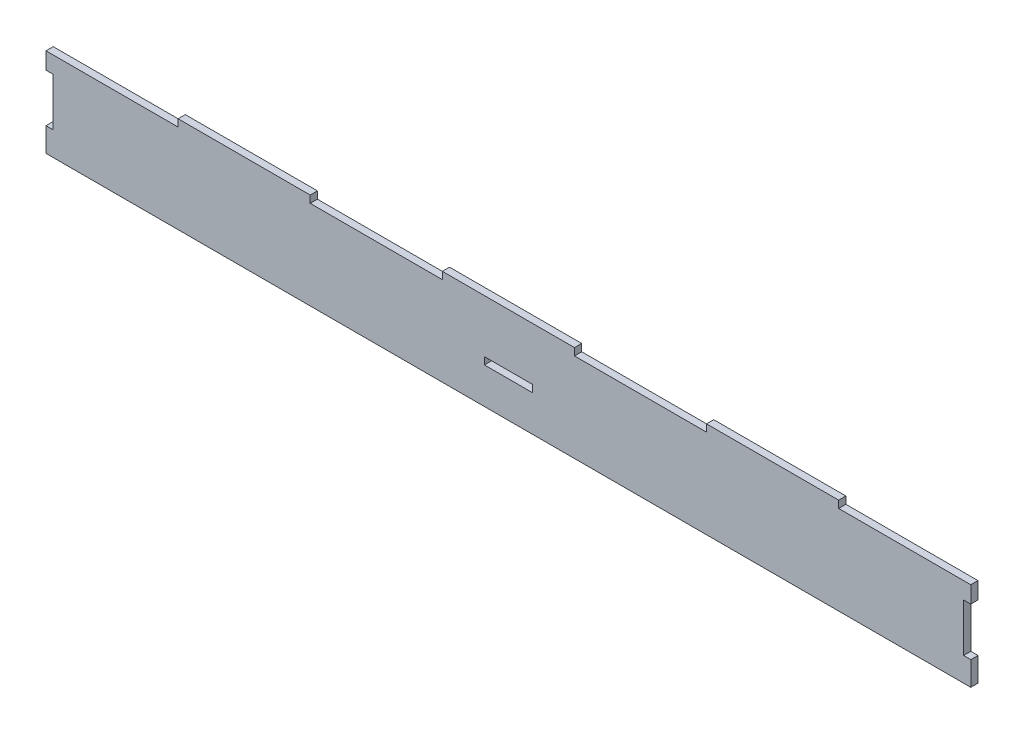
ISO-10303-21;
HEADER;
FILE_DESCRIPTION(('STEP AP214'),'2;1');
FILE_NAME('part.step','',(''),(''),'','','');
FILE_SCHEMA(('AUTOMOTIVE_DESIGN { 1 0 10303 214 1 1 1 1 }'));
ENDSEC;
DATA;
#1=APPLICATION_CONTEXT('core data for automotive mechanical design processes');
#2=APPLICATION_PROTOCOL_DEFINITION('international standard','automotive_design',2000,#1);
#3=PRODUCT_CONTEXT('',#1,'mechanical');
#4=PRODUCT('Part','Part','',(#3));
#5=PRODUCT_RELATED_PRODUCT_CATEGORY('part','',(#4));
#6=PRODUCT_DEFINITION_FORMATION('','',#4);
#7=PRODUCT_DEFINITION_CONTEXT('part definition',#1,'design');
#8=PRODUCT_DEFINITION('design','',#6,#7);
#9=PRODUCT_DEFINITION_SHAPE('','',#8);
#10=(LENGTH_UNIT() NAMED_UNIT(*) SI_UNIT(.MILLI.,.METRE.));
#11=(NAMED_UNIT(*) PLANE_ANGLE_UNIT() SI_UNIT($,.RADIAN.));
#12=(NAMED_UNIT(*) SI_UNIT($,.STERADIAN.) SOLID_ANGLE_UNIT());
#13=UNCERTAINTY_MEASURE_WITH_UNIT(LENGTH_MEASURE(1.E-05),#10,'distance_accuracy_value','');
#14=(GEOMETRIC_REPRESENTATION_CONTEXT(3) GLOBAL_UNCERTAINTY_ASSIGNED_CONTEXT((#13)) GLOBAL_UNIT_ASSIGNED_CONTEXT((#10,
#11,#12)) REPRESENTATION_CONTEXT('',''));
#15=CARTESIAN_POINT('',(0.,0.,0.));
#16=DIRECTION('',(0.,0.,1.));
#17=DIRECTION('',(1.,0.,0.));
#18=AXIS2_PLACEMENT_3D('',#15,#16,#17);
#19=CARTESIAN_POINT('',(192.5,20.,3.));
#20=DIRECTION('',(-1.,0.,0.));
#21=DIRECTION('',(0.,0.,1.));
#22=AXIS2_PLACEMENT_3D('',#19,#20,#21);
#23=PLANE('',#22);
#24=DIRECTION('',(0.,1.,0.));
#25=VECTOR('',#24,1.);
#26=CARTESIAN_POINT('',(192.5,20.,3.));
#27=LINE('',#26,#25);
#28=CARTESIAN_POINT('',(192.5,9.99999999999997,3.));
#29=VERTEX_POINT('',#28);
#30=CARTESIAN_POINT('',(192.5,17.,3.));
#31=VERTEX_POINT('',#30);
#32=EDGE_CURVE('E404',#29,#31,#27,.T.);
#33=ORIENTED_EDGE('',*,*,#32,.F.);
#34=DIRECTION('',(0.,0.,1.));
#35=VECTOR('',#34,1.);
#36=CARTESIAN_POINT('',(192.5,9.99999999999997,0.));
#37=LINE('',#36,#35);
#38=CARTESIAN_POINT('',(192.5,9.99999999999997,0.));
#39=VERTEX_POINT('',#38);
#40=EDGE_CURVE('E276',#39,#29,#37,.T.);
#41=ORIENTED_EDGE('',*,*,#40,.F.);
#42=DIRECTION('',(0.,1.,0.));
#43=VECTOR('',#42,1.);
#44=CARTESIAN_POINT('',(192.5,20.,0.));
#45=LINE('',#44,#43);
#46=CARTESIAN_POINT('',(192.5,17.,0.));
#47=VERTEX_POINT('',#46);
#48=EDGE_CURVE('E396',#39,#47,#45,.T.);
#49=ORIENTED_EDGE('',*,*,#48,.T.);
#50=DIRECTION('',(0.,0.,1.));
#51=VECTOR('',#50,1.);
#52=CARTESIAN_POINT('',(192.5,17.,0.));
#53=LINE('',#52,#51);
#54=EDGE_CURVE('E323',#47,#31,#53,.T.);
#55=ORIENTED_EDGE('',*,*,#54,.T.);
#56=EDGE_LOOP('',(#33,#41,#49,#55));
#57=FACE_BOUND('',#56,.T.);
#58=ADVANCED_FACE('F34',(#57),#23,.F.);
#59=CARTESIAN_POINT('',(-192.5,20.,3.));
#60=DIRECTION('',(1.,0.,0.));
#61=DIRECTION('',(0.,0.,-1.));
#62=AXIS2_PLACEMENT_3D('',#59,#60,#61);
#63=PLANE('',#62);
#64=DIRECTION('',(0.,-1.,0.));
#65=VECTOR('',#64,1.);
#66=CARTESIAN_POINT('',(-192.5,20.,0.));
#67=LINE('',#66,#65);
#68=CARTESIAN_POINT('',(-192.5,17.,0.));
#69=VERTEX_POINT('',#68);
#70=CARTESIAN_POINT('',(-192.5,9.99999999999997,0.));
#71=VERTEX_POINT('',#70);
#72=EDGE_CURVE('E422',#69,#71,#67,.T.);
#73=ORIENTED_EDGE('',*,*,#72,.T.);
#74=DIRECTION('',(0.,0.,1.));
#75=VECTOR('',#74,1.);
#76=CARTESIAN_POINT('',(-192.5,9.99999999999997,0.));
#77=LINE('',#76,#75);
#78=CARTESIAN_POINT('',(-192.5,9.99999999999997,3.));
#79=VERTEX_POINT('',#78);
#80=EDGE_CURVE('E299',#71,#79,#77,.T.);
#81=ORIENTED_EDGE('',*,*,#80,.T.);
#82=DIRECTION('',(0.,-1.,0.));
#83=VECTOR('',#82,1.);
#84=CARTESIAN_POINT('',(-192.5,20.,3.));
#85=LINE('',#84,#83);
#86=CARTESIAN_POINT('',(-192.5,17.,3.));
#87=VERTEX_POINT('',#86);
#88=EDGE_CURVE('E409',#87,#79,#85,.T.);
#89=ORIENTED_EDGE('',*,*,#88,.F.);
#90=DIRECTION('',(0.,0.,1.));
#91=VECTOR('',#90,1.);
#92=CARTESIAN_POINT('',(-192.5,17.,0.));
#93=LINE('',#92,#91);
#94=EDGE_CURVE('E388',#69,#87,#93,.T.);
#95=ORIENTED_EDGE('',*,*,#94,.F.);
#96=EDGE_LOOP('',(#73,#81,#89,#95));
#97=FACE_BOUND('',#96,.T.);
#98=ADVANCED_FACE('F465',(#97),#63,.F.);
#99=CARTESIAN_POINT('',(-192.5,20.,3.));
#100=DIRECTION('',(0.,-1.,0.));
#101=DIRECTION('',(0.,0.,-1.));
#102=AXIS2_PLACEMENT_3D('',#99,#100,#101);
#103=PLANE('',#102);
#104=DIRECTION('',(-1.,0.,0.));
#105=VECTOR('',#104,1.);
#106=CARTESIAN_POINT('',(-192.5,20.,3.));
#107=LINE('',#106,#105);
#108=CARTESIAN_POINT('',(27.5,20.,3.));
#109=VERTEX_POINT('',#108);
#110=CARTESIAN_POINT('',(-27.5,20.,3.));
#111=VERTEX_POINT('',#110);
#112=EDGE_CURVE('E408',#109,#111,#107,.T.);
#113=ORIENTED_EDGE('',*,*,#112,.F.);
#114=DIRECTION('',(0.,0.,1.));
#115=VECTOR('',#114,1.);
#116=CARTESIAN_POINT('',(27.5,20.,0.));
#117=LINE('',#116,#115);
#118=CARTESIAN_POINT('',(27.5,20.,0.));
#119=VERTEX_POINT('',#118);
#120=EDGE_CURVE('E345',#119,#109,#117,.T.);
#121=ORIENTED_EDGE('',*,*,#120,.F.);
#122=DIRECTION('',(-1.,0.,0.));
#123=VECTOR('',#122,1.);
#124=CARTESIAN_POINT('',(-192.5,20.,0.));
#125=LINE('',#124,#123);
#126=CARTESIAN_POINT('',(-27.5,20.,0.));
#127=VERTEX_POINT('',#126);
#128=EDGE_CURVE('E421',#119,#127,#125,.T.);
#129=ORIENTED_EDGE('',*,*,#128,.T.);
#130=DIRECTION('',(0.,0.,1.));
#131=VECTOR('',#130,1.);
#132=CARTESIAN_POINT('',(-27.5,20.,0.));
#133=LINE('',#132,#131);
#134=EDGE_CURVE('E375',#127,#111,#133,.T.);
#135=ORIENTED_EDGE('',*,*,#134,.T.);
#136=EDGE_LOOP('',(#113,#121,#129,#135));
#137=FACE_BOUND('',#136,.T.);
#138=ADVANCED_FACE('F486',(#137),#103,.F.);
#139=CARTESIAN_POINT('',(-82.5,20.,3.));
#140=VERTEX_POINT('',#139);
#141=CARTESIAN_POINT('',(-137.5,20.,3.));
#142=VERTEX_POINT('',#141);
#143=EDGE_CURVE('E403',#140,#142,#107,.T.);
#144=ORIENTED_EDGE('',*,*,#143,.F.);
#145=DIRECTION('',(0.,0.,1.));
#146=VECTOR('',#145,1.);
#147=CARTESIAN_POINT('',(-82.5,20.,0.));
#148=LINE('',#147,#146);
#149=CARTESIAN_POINT('',(-82.5,20.,0.));
#150=VERTEX_POINT('',#149);
#151=EDGE_CURVE('E372',#150,#140,#148,.T.);
#152=ORIENTED_EDGE('',*,*,#151,.F.);
#153=CARTESIAN_POINT('',(-137.5,20.,0.));
#154=VERTEX_POINT('',#153);
#155=EDGE_CURVE('E417',#150,#154,#125,.T.);
#156=ORIENTED_EDGE('',*,*,#155,.T.);
#157=DIRECTION('',(0.,0.,1.));
#158=VECTOR('',#157,1.);
#159=CARTESIAN_POINT('',(-137.5,20.,0.));
#160=LINE('',#159,#158);
#161=EDGE_CURVE('E393',#154,#142,#160,.T.);
#162=ORIENTED_EDGE('',*,*,#161,.T.);
#163=EDGE_LOOP('',(#144,#152,#156,#162));
#164=FACE_BOUND('',#163,.T.);
#165=ADVANCED_FACE('F478',(#164),#103,.F.);
#166=CARTESIAN_POINT('',(192.5,-20.,0.));
#167=VERTEX_POINT('',#166);
#168=CARTESIAN_POINT('',(192.5,-10.,0.));
#169=VERTEX_POINT('',#168);
#170=EDGE_CURVE('E414',#167,#169,#45,.T.);
#171=ORIENTED_EDGE('',*,*,#170,.T.);
#172=DIRECTION('',(0.,0.,1.));
#173=VECTOR('',#172,1.);
#174=CARTESIAN_POINT('',(192.5,-10.,0.));
#175=LINE('',#174,#173);
#176=CARTESIAN_POINT('',(192.5,-10.,3.));
#177=VERTEX_POINT('',#176);
#178=EDGE_CURVE('E278',#169,#177,#175,.T.);
#179=ORIENTED_EDGE('',*,*,#178,.T.);
#180=CARTESIAN_POINT('',(192.5,-20.,3.));
#181=VERTEX_POINT('',#180);
#182=EDGE_CURVE('E400',#181,#177,#27,.T.);
#183=ORIENTED_EDGE('',*,*,#182,.F.);
#184=DIRECTION('',(0.,0.,-1.));
#185=VECTOR('',#184,1.);
#186=CARTESIAN_POINT('',(192.5,-20.,3.));
#187=LINE('',#186,#185);
#188=EDGE_CURVE('E42',#181,#167,#187,.T.);
#189=ORIENTED_EDGE('',*,*,#188,.T.);
#190=EDGE_LOOP('',(#171,#179,#183,#189));
#191=FACE_BOUND('',#190,.T.);
#192=ADVANCED_FACE('F36',(#191),#23,.F.);
#193=CARTESIAN_POINT('',(137.5,20.,3.));
#194=VERTEX_POINT('',#193);
#195=CARTESIAN_POINT('',(82.5,20.,3.));
#196=VERTEX_POINT('',#195);
#197=EDGE_CURVE('E405',#194,#196,#107,.T.);
#198=ORIENTED_EDGE('',*,*,#197,.F.);
#199=DIRECTION('',(0.,0.,1.));
#200=VECTOR('',#199,1.);
#201=CARTESIAN_POINT('',(137.5,20.,0.));
#202=LINE('',#201,#200);
#203=CARTESIAN_POINT('',(137.5,20.,0.));
#204=VERTEX_POINT('',#203);
#205=EDGE_CURVE('E320',#204,#194,#202,.T.);
#206=ORIENTED_EDGE('',*,*,#205,.F.);
#207=CARTESIAN_POINT('',(82.5,20.,0.));
#208=VERTEX_POINT('',#207);
#209=EDGE_CURVE('E418',#204,#208,#125,.T.);
#210=ORIENTED_EDGE('',*,*,#209,.T.);
#211=DIRECTION('',(0.,0.,1.));
#212=VECTOR('',#211,1.);
#213=CARTESIAN_POINT('',(82.5,20.,0.));
#214=LINE('',#213,#212);
#215=EDGE_CURVE('E348',#208,#196,#214,.T.);
#216=ORIENTED_EDGE('',*,*,#215,.T.);
#217=EDGE_LOOP('',(#198,#206,#210,#216));
#218=FACE_BOUND('',#217,.T.);
#219=ADVANCED_FACE('F510',(#218),#103,.F.);
#220=CARTESIAN_POINT('',(-192.5,-10.,3.));
#221=VERTEX_POINT('',#220);
#222=CARTESIAN_POINT('',(-192.5,-20.,3.));
#223=VERTEX_POINT('',#222);
#224=EDGE_CURVE('E407',#221,#223,#85,.T.);
#225=ORIENTED_EDGE('',*,*,#224,.F.);
#226=DIRECTION('',(0.,0.,1.));
#227=VECTOR('',#226,1.);
#228=CARTESIAN_POINT('',(-192.5,-10.,0.));
#229=LINE('',#228,#227);
#230=CARTESIAN_POINT('',(-192.5,-10.,0.));
#231=VERTEX_POINT('',#230);
#232=EDGE_CURVE('E292',#231,#221,#229,.T.);
#233=ORIENTED_EDGE('',*,*,#232,.F.);
#234=CARTESIAN_POINT('',(-192.5,-20.,0.));
#235=VERTEX_POINT('',#234);
#236=EDGE_CURVE('E420',#231,#235,#67,.T.);
#237=ORIENTED_EDGE('',*,*,#236,.T.);
#238=DIRECTION('',(0.,0.,-1.));
#239=VECTOR('',#238,1.);
#240=CARTESIAN_POINT('',(-192.5,-20.,3.));
#241=LINE('',#240,#239);
#242=EDGE_CURVE('E11',#223,#235,#241,.T.);
#243=ORIENTED_EDGE('',*,*,#242,.F.);
#244=EDGE_LOOP('',(#225,#233,#237,#243));
#245=FACE_BOUND('',#244,.T.);
#246=ADVANCED_FACE('F450',(#245),#63,.F.);
#247=CARTESIAN_POINT('',(-192.5,-20.,3.));
#248=DIRECTION('',(0.,1.,0.));
#249=DIRECTION('',(0.,0.,1.));
#250=AXIS2_PLACEMENT_3D('',#247,#248,#249);
#251=PLANE('',#250);
#252=DIRECTION('',(1.,0.,0.));
#253=VECTOR('',#252,1.);
#254=CARTESIAN_POINT('',(-192.5,-20.,0.));
#255=LINE('',#254,#253);
#256=EDGE_CURVE('E425',#235,#167,#255,.T.);
#257=ORIENTED_EDGE('',*,*,#256,.T.);
#258=ORIENTED_EDGE('',*,*,#188,.F.);
#259=DIRECTION('',(1.,0.,0.));
#260=VECTOR('',#259,1.);
#261=CARTESIAN_POINT('',(-192.5,-20.,3.));
#262=LINE('',#261,#260);
#263=EDGE_CURVE('E412',#223,#181,#262,.T.);
#264=ORIENTED_EDGE('',*,*,#263,.F.);
#265=ORIENTED_EDGE('',*,*,#242,.T.);
#266=EDGE_LOOP('',(#257,#258,#264,#265));
#267=FACE_BOUND('',#266,.T.);
#268=ADVANCED_FACE('F448',(#267),#251,.F.);
#269=CARTESIAN_POINT('',(0.,0.,3.));
#270=DIRECTION('',(0.,0.,1.));
#271=DIRECTION('',(1.,0.,0.));
#272=AXIS2_PLACEMENT_3D('',#269,#270,#271);
#273=PLANE('',#272);
#274=DIRECTION('',(0.,1.,0.));
#275=VECTOR('',#274,1.);
#276=CARTESIAN_POINT('',(10.,-2.,3.));
#277=LINE('',#276,#275);
#278=CARTESIAN_POINT('',(10.,-5.,3.));
#279=VERTEX_POINT('',#278);
#280=CARTESIAN_POINT('',(10.,-2.,3.));
#281=VERTEX_POINT('',#280);
#282=EDGE_CURVE('E49',#279,#281,#277,.T.);
#283=ORIENTED_EDGE('',*,*,#282,.F.);
#284=DIRECTION('',(1.,0.,0.));
#285=VECTOR('',#284,1.);
#286=CARTESIAN_POINT('',(-10.,-5.,3.));
#287=LINE('',#286,#285);
#288=CARTESIAN_POINT('',(-10.,-5.,3.));
#289=VERTEX_POINT('',#288);
#290=EDGE_CURVE('E237',#289,#279,#287,.T.);
#291=ORIENTED_EDGE('',*,*,#290,.F.);
#292=DIRECTION('',(0.,-1.,0.));
#293=VECTOR('',#292,1.);
#294=CARTESIAN_POINT('',(-10.,-2.,3.));
#295=LINE('',#294,#293);
#296=CARTESIAN_POINT('',(-10.,-2.,3.));
#297=VERTEX_POINT('',#296);
#298=EDGE_CURVE('E240',#297,#289,#295,.T.);
#299=ORIENTED_EDGE('',*,*,#298,.F.);
#300=DIRECTION('',(-1.,0.,0.));
#301=VECTOR('',#300,1.);
#302=CARTESIAN_POINT('',(-10.,-2.,3.));
#303=LINE('',#302,#301);
#304=EDGE_CURVE('E246',#281,#297,#303,.T.);
#305=ORIENTED_EDGE('',*,*,#304,.F.);
#306=EDGE_LOOP('',(#283,#291,#299,#305));
#307=FACE_BOUND('',#306,.T.);
#308=DIRECTION('',(-1.,0.,0.));
#309=VECTOR('',#308,1.);
#310=CARTESIAN_POINT('',(189.5,9.99999999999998,3.));
#311=LINE('',#310,#309);
#312=CARTESIAN_POINT('',(189.5,9.99999999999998,3.));
#313=VERTEX_POINT('',#312);
#314=EDGE_CURVE('E260',#29,#313,#311,.T.);
#315=ORIENTED_EDGE('',*,*,#314,.F.);
#316=ORIENTED_EDGE('',*,*,#32,.T.);
#317=DIRECTION('',(1.,0.,0.));
#318=VECTOR('',#317,1.);
#319=CARTESIAN_POINT('',(137.5,17.,3.));
#320=LINE('',#319,#318);
#321=CARTESIAN_POINT('',(137.5,17.,3.));
#322=VERTEX_POINT('',#321);
#323=EDGE_CURVE('E312',#322,#31,#320,.T.);
#324=ORIENTED_EDGE('',*,*,#323,.F.);
#325=DIRECTION('',(0.,-1.,0.));
#326=VECTOR('',#325,1.);
#327=CARTESIAN_POINT('',(137.5,20.,3.));
#328=LINE('',#327,#326);
#329=EDGE_CURVE('E302',#194,#322,#328,.T.);
#330=ORIENTED_EDGE('',*,*,#329,.F.);
#331=ORIENTED_EDGE('',*,*,#197,.T.);
#332=DIRECTION('',(0.,1.,0.));
#333=VECTOR('',#332,1.);
#334=CARTESIAN_POINT('',(82.5,20.,3.));
#335=LINE('',#334,#333);
#336=CARTESIAN_POINT('',(82.5,17.,3.));
#337=VERTEX_POINT('',#336);
#338=EDGE_CURVE('E331',#337,#196,#335,.T.);
#339=ORIENTED_EDGE('',*,*,#338,.F.);
#340=DIRECTION('',(1.,0.,0.));
#341=VECTOR('',#340,1.);
#342=CARTESIAN_POINT('',(27.5,17.,3.));
#343=LINE('',#342,#341);
#344=CARTESIAN_POINT('',(27.5,17.,3.));
#345=VERTEX_POINT('',#344);
#346=EDGE_CURVE('E340',#345,#337,#343,.T.);
#347=ORIENTED_EDGE('',*,*,#346,.F.);
#348=DIRECTION('',(0.,-1.,0.));
#349=VECTOR('',#348,1.);
#350=CARTESIAN_POINT('',(27.5,20.,3.));
#351=LINE('',#350,#349);
#352=EDGE_CURVE('E322',#109,#345,#351,.T.);
#353=ORIENTED_EDGE('',*,*,#352,.F.);
#354=ORIENTED_EDGE('',*,*,#112,.T.);
#355=DIRECTION('',(0.,1.,0.));
#356=VECTOR('',#355,1.);
#357=CARTESIAN_POINT('',(-27.5,20.,3.));
#358=LINE('',#357,#356);
#359=CARTESIAN_POINT('',(-27.5,17.,3.));
#360=VERTEX_POINT('',#359);
#361=EDGE_CURVE('E358',#360,#111,#358,.T.);
#362=ORIENTED_EDGE('',*,*,#361,.F.);
#363=DIRECTION('',(1.,0.,0.));
#364=VECTOR('',#363,1.);
#365=CARTESIAN_POINT('',(-82.5,17.,3.));
#366=LINE('',#365,#364);
#367=CARTESIAN_POINT('',(-82.5,17.,3.));
#368=VERTEX_POINT('',#367);
#369=EDGE_CURVE('E367',#368,#360,#366,.T.);
#370=ORIENTED_EDGE('',*,*,#369,.F.);
#371=DIRECTION('',(0.,-1.,0.));
#372=VECTOR('',#371,1.);
#373=CARTESIAN_POINT('',(-82.5,20.,3.));
#374=LINE('',#373,#372);
#375=EDGE_CURVE('E347',#140,#368,#374,.T.);
#376=ORIENTED_EDGE('',*,*,#375,.F.);
#377=ORIENTED_EDGE('',*,*,#143,.T.);
#378=DIRECTION('',(0.,1.,0.));
#379=VECTOR('',#378,1.);
#380=CARTESIAN_POINT('',(-137.5,20.,3.));
#381=LINE('',#380,#379);
#382=CARTESIAN_POINT('',(-137.5,17.,3.));
#383=VERTEX_POINT('',#382);
#384=EDGE_CURVE('E385',#383,#142,#381,.T.);
#385=ORIENTED_EDGE('',*,*,#384,.F.);
#386=DIRECTION('',(1.,0.,0.));
#387=VECTOR('',#386,1.);
#388=CARTESIAN_POINT('',(-192.5,17.,3.));
#389=LINE('',#388,#387);
#390=EDGE_CURVE('E374',#87,#383,#389,.T.);
#391=ORIENTED_EDGE('',*,*,#390,.F.);
#392=ORIENTED_EDGE('',*,*,#88,.T.);
#393=DIRECTION('',(-1.,0.,0.));
#394=VECTOR('',#393,1.);
#395=CARTESIAN_POINT('',(-189.5,9.99999999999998,3.));
#396=LINE('',#395,#394);
#397=CARTESIAN_POINT('',(-189.5,9.99999999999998,3.));
#398=VERTEX_POINT('',#397);
#399=EDGE_CURVE('E286',#398,#79,#396,.T.);
#400=ORIENTED_EDGE('',*,*,#399,.F.);
#401=DIRECTION('',(0.,1.,0.));
#402=VECTOR('',#401,1.);
#403=CARTESIAN_POINT('',(-189.5,9.99999999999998,3.));
#404=LINE('',#403,#402);
#405=CARTESIAN_POINT('',(-189.5,-10.,3.));
#406=VERTEX_POINT('',#405);
#407=EDGE_CURVE('E295',#406,#398,#404,.T.);
#408=ORIENTED_EDGE('',*,*,#407,.F.);
#409=DIRECTION('',(1.,0.,0.));
#410=VECTOR('',#409,1.);
#411=CARTESIAN_POINT('',(-189.5,-10.,3.));
#412=LINE('',#411,#410);
#413=EDGE_CURVE('E275',#221,#406,#412,.T.);
#414=ORIENTED_EDGE('',*,*,#413,.F.);
#415=ORIENTED_EDGE('',*,*,#224,.T.);
#416=ORIENTED_EDGE('',*,*,#263,.T.);
#417=ORIENTED_EDGE('',*,*,#182,.T.);
#418=DIRECTION('',(1.,0.,0.));
#419=VECTOR('',#418,1.);
#420=CARTESIAN_POINT('',(189.5,-10.,3.));
#421=LINE('',#420,#419);
#422=CARTESIAN_POINT('',(189.5,-10.,3.));
#423=VERTEX_POINT('',#422);
#424=EDGE_CURVE('E269',#423,#177,#421,.T.);
#425=ORIENTED_EDGE('',*,*,#424,.F.);
#426=DIRECTION('',(0.,-1.,0.));
#427=VECTOR('',#426,1.);
#428=CARTESIAN_POINT('',(189.5,9.99999999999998,3.));
#429=LINE('',#428,#427);
#430=EDGE_CURVE('E252',#313,#423,#429,.T.);
#431=ORIENTED_EDGE('',*,*,#430,.F.);
#432=EDGE_LOOP('',(#315,#316,#324,#330,#331,#339,#347,#353,#354,#362,#370,#376,#377,#385,#391,
#392,#400,#408,#414,#415,#416,#417,#425,#431));
#433=FACE_BOUND('',#432,.T.);
#434=ADVANCED_FACE('F443',(#307,#433),#273,.T.);
#435=CARTESIAN_POINT('',(0.,0.,0.));
#436=DIRECTION('',(0.,0.,1.));
#437=DIRECTION('',(1.,0.,0.));
#438=AXIS2_PLACEMENT_3D('',#435,#436,#437);
#439=PLANE('',#438);
#440=DIRECTION('',(1.,0.,0.));
#441=VECTOR('',#440,1.);
#442=CARTESIAN_POINT('',(-10.,-5.,0.));
#443=LINE('',#442,#441);
#444=CARTESIAN_POINT('',(-10.,-5.,0.));
#445=VERTEX_POINT('',#444);
#446=CARTESIAN_POINT('',(10.,-5.,0.));
#447=VERTEX_POINT('',#446);
#448=EDGE_CURVE('E227',#445,#447,#443,.T.);
#449=ORIENTED_EDGE('',*,*,#448,.T.);
#450=DIRECTION('',(0.,1.,0.));
#451=VECTOR('',#450,1.);
#452=CARTESIAN_POINT('',(10.,-2.,0.));
#453=LINE('',#452,#451);
#454=CARTESIAN_POINT('',(10.,-2.,0.));
#455=VERTEX_POINT('',#454);
#456=EDGE_CURVE('E221',#447,#455,#453,.T.);
#457=ORIENTED_EDGE('',*,*,#456,.T.);
#458=DIRECTION('',(-1.,0.,0.));
#459=VECTOR('',#458,1.);
#460=CARTESIAN_POINT('',(-10.,-2.,0.));
#461=LINE('',#460,#459);
#462=CARTESIAN_POINT('',(-10.,-2.,0.));
#463=VERTEX_POINT('',#462);
#464=EDGE_CURVE('E230',#455,#463,#461,.T.);
#465=ORIENTED_EDGE('',*,*,#464,.T.);
#466=DIRECTION('',(0.,-1.,0.));
#467=VECTOR('',#466,1.);
#468=CARTESIAN_POINT('',(-10.,-2.,0.));
#469=LINE('',#468,#467);
#470=EDGE_CURVE('E57',#463,#445,#469,.T.);
#471=ORIENTED_EDGE('',*,*,#470,.T.);
#472=EDGE_LOOP('',(#449,#457,#465,#471));
#473=FACE_BOUND('',#472,.T.);
#474=ORIENTED_EDGE('',*,*,#48,.F.);
#475=DIRECTION('',(-1.,0.,0.));
#476=VECTOR('',#475,1.);
#477=CARTESIAN_POINT('',(189.5,9.99999999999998,0.));
#478=LINE('',#477,#476);
#479=CARTESIAN_POINT('',(189.5,9.99999999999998,0.));
#480=VERTEX_POINT('',#479);
#481=EDGE_CURVE('E263',#39,#480,#478,.T.);
#482=ORIENTED_EDGE('',*,*,#481,.T.);
#483=DIRECTION('',(0.,-1.,0.));
#484=VECTOR('',#483,1.);
#485=CARTESIAN_POINT('',(189.5,9.99999999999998,0.));
#486=LINE('',#485,#484);
#487=CARTESIAN_POINT('',(189.5,-10.,0.));
#488=VERTEX_POINT('',#487);
#489=EDGE_CURVE('E256',#480,#488,#486,.T.);
#490=ORIENTED_EDGE('',*,*,#489,.T.);
#491=DIRECTION('',(1.,0.,0.));
#492=VECTOR('',#491,1.);
#493=CARTESIAN_POINT('',(189.5,-10.,0.));
#494=LINE('',#493,#492);
#495=EDGE_CURVE('E259',#488,#169,#494,.T.);
#496=ORIENTED_EDGE('',*,*,#495,.T.);
#497=ORIENTED_EDGE('',*,*,#170,.F.);
#498=ORIENTED_EDGE('',*,*,#256,.F.);
#499=ORIENTED_EDGE('',*,*,#236,.F.);
#500=DIRECTION('',(1.,0.,0.));
#501=VECTOR('',#500,1.);
#502=CARTESIAN_POINT('',(-189.5,-10.,0.));
#503=LINE('',#502,#501);
#504=CARTESIAN_POINT('',(-189.5,-10.,0.));
#505=VERTEX_POINT('',#504);
#506=EDGE_CURVE('E282',#231,#505,#503,.T.);
#507=ORIENTED_EDGE('',*,*,#506,.T.);
#508=DIRECTION('',(0.,1.,0.));
#509=VECTOR('',#508,1.);
#510=CARTESIAN_POINT('',(-189.5,9.99999999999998,0.));
#511=LINE('',#510,#509);
#512=CARTESIAN_POINT('',(-189.5,9.99999999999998,0.));
#513=VERTEX_POINT('',#512);
#514=EDGE_CURVE('E285',#505,#513,#511,.T.);
#515=ORIENTED_EDGE('',*,*,#514,.T.);
#516=DIRECTION('',(-1.,0.,0.));
#517=VECTOR('',#516,1.);
#518=CARTESIAN_POINT('',(-189.5,9.99999999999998,0.));
#519=LINE('',#518,#517);
#520=EDGE_CURVE('E289',#513,#71,#519,.T.);
#521=ORIENTED_EDGE('',*,*,#520,.T.);
#522=ORIENTED_EDGE('',*,*,#72,.F.);
#523=DIRECTION('',(1.,0.,0.));
#524=VECTOR('',#523,1.);
#525=CARTESIAN_POINT('',(-192.5,17.,0.));
#526=LINE('',#525,#524);
#527=CARTESIAN_POINT('',(-137.5,17.,0.));
#528=VERTEX_POINT('',#527);
#529=EDGE_CURVE('E381',#69,#528,#526,.T.);
#530=ORIENTED_EDGE('',*,*,#529,.T.);
#531=DIRECTION('',(0.,1.,0.));
#532=VECTOR('',#531,1.);
#533=CARTESIAN_POINT('',(-137.5,20.,0.));
#534=LINE('',#533,#532);
#535=EDGE_CURVE('E384',#528,#154,#534,.T.);
#536=ORIENTED_EDGE('',*,*,#535,.T.);
#537=ORIENTED_EDGE('',*,*,#155,.F.);
#538=DIRECTION('',(0.,-1.,0.));
#539=VECTOR('',#538,1.);
#540=CARTESIAN_POINT('',(-82.5,20.,0.));
#541=LINE('',#540,#539);
#542=CARTESIAN_POINT('',(-82.5,17.,0.));
#543=VERTEX_POINT('',#542);
#544=EDGE_CURVE('E354',#150,#543,#541,.T.);
#545=ORIENTED_EDGE('',*,*,#544,.T.);
#546=DIRECTION('',(1.,0.,0.));
#547=VECTOR('',#546,1.);
#548=CARTESIAN_POINT('',(-82.5,17.,0.));
#549=LINE('',#548,#547);
#550=CARTESIAN_POINT('',(-27.5,17.,0.));
#551=VERTEX_POINT('',#550);
#552=EDGE_CURVE('E357',#543,#551,#549,.T.);
#553=ORIENTED_EDGE('',*,*,#552,.T.);
#554=DIRECTION('',(0.,1.,0.));
#555=VECTOR('',#554,1.);
#556=CARTESIAN_POINT('',(-27.5,20.,0.));
#557=LINE('',#556,#555);
#558=EDGE_CURVE('E361',#551,#127,#557,.T.);
#559=ORIENTED_EDGE('',*,*,#558,.T.);
#560=ORIENTED_EDGE('',*,*,#128,.F.);
#561=DIRECTION('',(0.,-1.,0.));
#562=VECTOR('',#561,1.);
#563=CARTESIAN_POINT('',(27.5,20.,0.));
#564=LINE('',#563,#562);
#565=CARTESIAN_POINT('',(27.5,17.,0.));
#566=VERTEX_POINT('',#565);
#567=EDGE_CURVE('E327',#119,#566,#564,.T.);
#568=ORIENTED_EDGE('',*,*,#567,.T.);
#569=DIRECTION('',(1.,0.,0.));
#570=VECTOR('',#569,1.);
#571=CARTESIAN_POINT('',(27.5,17.,0.));
#572=LINE('',#571,#570);
#573=CARTESIAN_POINT('',(82.5,17.,0.));
#574=VERTEX_POINT('',#573);
#575=EDGE_CURVE('E330',#566,#574,#572,.T.);
#576=ORIENTED_EDGE('',*,*,#575,.T.);
#577=DIRECTION('',(0.,1.,0.));
#578=VECTOR('',#577,1.);
#579=CARTESIAN_POINT('',(82.5,20.,0.));
#580=LINE('',#579,#578);
#581=EDGE_CURVE('E334',#574,#208,#580,.T.);
#582=ORIENTED_EDGE('',*,*,#581,.T.);
#583=ORIENTED_EDGE('',*,*,#209,.F.);
#584=DIRECTION('',(0.,-1.,0.));
#585=VECTOR('',#584,1.);
#586=CARTESIAN_POINT('',(137.5,20.,0.));
#587=LINE('',#586,#585);
#588=CARTESIAN_POINT('',(137.5,17.,0.));
#589=VERTEX_POINT('',#588);
#590=EDGE_CURVE('E308',#204,#589,#587,.T.);
#591=ORIENTED_EDGE('',*,*,#590,.T.);
#592=DIRECTION('',(1.,0.,0.));
#593=VECTOR('',#592,1.);
#594=CARTESIAN_POINT('',(137.5,17.,0.));
#595=LINE('',#594,#593);
#596=EDGE_CURVE('E311',#589,#47,#595,.T.);
#597=ORIENTED_EDGE('',*,*,#596,.T.);
#598=EDGE_LOOP('',(#474,#482,#490,#496,#497,#498,#499,#507,#515,#521,#522,#530,#536,#537,#545,
#553,#559,#560,#568,#576,#582,#583,#591,#597));
#599=FACE_BOUND('',#598,.T.);
#600=ADVANCED_FACE('F234',(#473,#599),#439,.F.);
#601=CARTESIAN_POINT('',(-137.5,20.,0.));
#602=DIRECTION('',(1.,0.,0.));
#603=DIRECTION('',(0.,0.,-1.));
#604=AXIS2_PLACEMENT_3D('',#601,#602,#603);
#605=PLANE('',#604);
#606=ORIENTED_EDGE('',*,*,#384,.T.);
#607=ORIENTED_EDGE('',*,*,#161,.F.);
#608=ORIENTED_EDGE('',*,*,#535,.F.);
#609=DIRECTION('',(0.,0.,1.));
#610=VECTOR('',#609,1.);
#611=CARTESIAN_POINT('',(-137.5,17.,0.));
#612=LINE('',#611,#610);
#613=EDGE_CURVE('E397',#528,#383,#612,.T.);
#614=ORIENTED_EDGE('',*,*,#613,.T.);
#615=EDGE_LOOP('',(#606,#607,#608,#614));
#616=FACE_BOUND('',#615,.T.);
#617=ADVANCED_FACE('F476',(#616),#605,.F.);
#618=CARTESIAN_POINT('',(-192.5,17.,0.));
#619=DIRECTION('',(0.,-1.,0.));
#620=DIRECTION('',(0.,0.,-1.));
#621=AXIS2_PLACEMENT_3D('',#618,#619,#620);
#622=PLANE('',#621);
#623=ORIENTED_EDGE('',*,*,#390,.T.);
#624=ORIENTED_EDGE('',*,*,#613,.F.);
#625=ORIENTED_EDGE('',*,*,#529,.F.);
#626=ORIENTED_EDGE('',*,*,#94,.T.);
#627=EDGE_LOOP('',(#623,#624,#625,#626));
#628=FACE_BOUND('',#627,.T.);
#629=ADVANCED_FACE('F469',(#628),#622,.F.);
#630=CARTESIAN_POINT('',(-82.5,20.,0.));
#631=DIRECTION('',(-1.,0.,0.));
#632=DIRECTION('',(0.,0.,1.));
#633=AXIS2_PLACEMENT_3D('',#630,#631,#632);
#634=PLANE('',#633);
#635=ORIENTED_EDGE('',*,*,#375,.T.);
#636=DIRECTION('',(0.,0.,1.));
#637=VECTOR('',#636,1.);
#638=CARTESIAN_POINT('',(-82.5,17.,0.));
#639=LINE('',#638,#637);
#640=EDGE_CURVE('E364',#543,#368,#639,.T.);
#641=ORIENTED_EDGE('',*,*,#640,.F.);
#642=ORIENTED_EDGE('',*,*,#544,.F.);
#643=ORIENTED_EDGE('',*,*,#151,.T.);
#644=EDGE_LOOP('',(#635,#641,#642,#643));
#645=FACE_BOUND('',#644,.T.);
#646=ADVANCED_FACE('F561',(#645),#634,.F.);
#647=CARTESIAN_POINT('',(-27.5,20.,0.));
#648=DIRECTION('',(1.,0.,0.));
#649=DIRECTION('',(0.,0.,-1.));
#650=AXIS2_PLACEMENT_3D('',#647,#648,#649);
#651=PLANE('',#650);
#652=ORIENTED_EDGE('',*,*,#361,.T.);
#653=ORIENTED_EDGE('',*,*,#134,.F.);
#654=ORIENTED_EDGE('',*,*,#558,.F.);
#655=DIRECTION('',(0.,0.,1.));
#656=VECTOR('',#655,1.);
#657=CARTESIAN_POINT('',(-27.5,17.,0.));
#658=LINE('',#657,#656);
#659=EDGE_CURVE('E378',#551,#360,#658,.T.);
#660=ORIENTED_EDGE('',*,*,#659,.T.);
#661=EDGE_LOOP('',(#652,#653,#654,#660));
#662=FACE_BOUND('',#661,.T.);
#663=ADVANCED_FACE('F488',(#662),#651,.F.);
#664=CARTESIAN_POINT('',(-82.5,17.,0.));
#665=DIRECTION('',(0.,-1.,0.));
#666=DIRECTION('',(0.,0.,-1.));
#667=AXIS2_PLACEMENT_3D('',#664,#665,#666);
#668=PLANE('',#667);
#669=ORIENTED_EDGE('',*,*,#369,.T.);
#670=ORIENTED_EDGE('',*,*,#659,.F.);
#671=ORIENTED_EDGE('',*,*,#552,.F.);
#672=ORIENTED_EDGE('',*,*,#640,.T.);
#673=EDGE_LOOP('',(#669,#670,#671,#672));
#674=FACE_BOUND('',#673,.T.);
#675=ADVANCED_FACE('F493',(#674),#668,.F.);
#676=CARTESIAN_POINT('',(27.5,20.,0.));
#677=DIRECTION('',(-1.,0.,0.));
#678=DIRECTION('',(0.,0.,1.));
#679=AXIS2_PLACEMENT_3D('',#676,#677,#678);
#680=PLANE('',#679);
#681=ORIENTED_EDGE('',*,*,#352,.T.);
#682=DIRECTION('',(0.,0.,1.));
#683=VECTOR('',#682,1.);
#684=CARTESIAN_POINT('',(27.5,17.,0.));
#685=LINE('',#684,#683);
#686=EDGE_CURVE('E337',#566,#345,#685,.T.);
#687=ORIENTED_EDGE('',*,*,#686,.F.);
#688=ORIENTED_EDGE('',*,*,#567,.F.);
#689=ORIENTED_EDGE('',*,*,#120,.T.);
#690=EDGE_LOOP('',(#681,#687,#688,#689));
#691=FACE_BOUND('',#690,.T.);
#692=ADVANCED_FACE('F499',(#691),#680,.F.);
#693=CARTESIAN_POINT('',(82.5,20.,0.));
#694=DIRECTION('',(1.,0.,0.));
#695=DIRECTION('',(0.,0.,-1.));
#696=AXIS2_PLACEMENT_3D('',#693,#694,#695);
#697=PLANE('',#696);
#698=ORIENTED_EDGE('',*,*,#338,.T.);
#699=ORIENTED_EDGE('',*,*,#215,.F.);
#700=ORIENTED_EDGE('',*,*,#581,.F.);
#701=DIRECTION('',(0.,0.,1.));
#702=VECTOR('',#701,1.);
#703=CARTESIAN_POINT('',(82.5,17.,0.));
#704=LINE('',#703,#702);
#705=EDGE_CURVE('E351',#574,#337,#704,.T.);
#706=ORIENTED_EDGE('',*,*,#705,.T.);
#707=EDGE_LOOP('',(#698,#699,#700,#706));
#708=FACE_BOUND('',#707,.T.);
#709=ADVANCED_FACE('F506',(#708),#697,.F.);
#710=CARTESIAN_POINT('',(27.5,17.,0.));
#711=DIRECTION('',(0.,-1.,0.));
#712=DIRECTION('',(0.,0.,-1.));
#713=AXIS2_PLACEMENT_3D('',#710,#711,#712);
#714=PLANE('',#713);
#715=ORIENTED_EDGE('',*,*,#346,.T.);
#716=ORIENTED_EDGE('',*,*,#705,.F.);
#717=ORIENTED_EDGE('',*,*,#575,.F.);
#718=ORIENTED_EDGE('',*,*,#686,.T.);
#719=EDGE_LOOP('',(#715,#716,#717,#718));
#720=FACE_BOUND('',#719,.T.);
#721=ADVANCED_FACE('F504',(#720),#714,.F.);
#722=CARTESIAN_POINT('',(137.5,20.,0.));
#723=DIRECTION('',(-1.,0.,0.));
#724=DIRECTION('',(0.,0.,1.));
#725=AXIS2_PLACEMENT_3D('',#722,#723,#724);
#726=PLANE('',#725);
#727=ORIENTED_EDGE('',*,*,#329,.T.);
#728=DIRECTION('',(0.,0.,1.));
#729=VECTOR('',#728,1.);
#730=CARTESIAN_POINT('',(137.5,17.,0.));
#731=LINE('',#730,#729);
#732=EDGE_CURVE('E315',#589,#322,#731,.T.);
#733=ORIENTED_EDGE('',*,*,#732,.F.);
#734=ORIENTED_EDGE('',*,*,#590,.F.);
#735=ORIENTED_EDGE('',*,*,#205,.T.);
#736=EDGE_LOOP('',(#727,#733,#734,#735));
#737=FACE_BOUND('',#736,.T.);
#738=ADVANCED_FACE('F514',(#737),#726,.F.);
#739=CARTESIAN_POINT('',(137.5,17.,0.));
#740=DIRECTION('',(0.,-1.,0.));
#741=DIRECTION('',(0.,0.,-1.));
#742=AXIS2_PLACEMENT_3D('',#739,#740,#741);
#743=PLANE('',#742);
#744=ORIENTED_EDGE('',*,*,#323,.T.);
#745=ORIENTED_EDGE('',*,*,#54,.F.);
#746=ORIENTED_EDGE('',*,*,#596,.F.);
#747=ORIENTED_EDGE('',*,*,#732,.T.);
#748=EDGE_LOOP('',(#744,#745,#746,#747));
#749=FACE_BOUND('',#748,.T.);
#750=ADVANCED_FACE('F519',(#749),#743,.F.);
#751=CARTESIAN_POINT('',(-189.5,9.99999999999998,0.));
#752=DIRECTION('',(0.,1.,0.));
#753=DIRECTION('',(-1.,0.,0.));
#754=AXIS2_PLACEMENT_3D('',#751,#752,#753);
#755=PLANE('',#754);
#756=ORIENTED_EDGE('',*,*,#399,.T.);
#757=ORIENTED_EDGE('',*,*,#80,.F.);
#758=ORIENTED_EDGE('',*,*,#520,.F.);
#759=DIRECTION('',(0.,0.,1.));
#760=VECTOR('',#759,1.);
#761=CARTESIAN_POINT('',(-189.5,9.99999999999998,0.));
#762=LINE('',#761,#760);
#763=EDGE_CURVE('E303',#513,#398,#762,.T.);
#764=ORIENTED_EDGE('',*,*,#763,.T.);
#765=EDGE_LOOP('',(#756,#757,#758,#764));
#766=FACE_BOUND('',#765,.T.);
#767=ADVANCED_FACE('F461',(#766),#755,.F.);
#768=CARTESIAN_POINT('',(-189.5,9.99999999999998,0.));
#769=DIRECTION('',(1.,0.,0.));
#770=DIRECTION('',(0.,0.,-1.));
#771=AXIS2_PLACEMENT_3D('',#768,#769,#770);
#772=PLANE('',#771);
#773=ORIENTED_EDGE('',*,*,#407,.T.);
#774=ORIENTED_EDGE('',*,*,#763,.F.);
#775=ORIENTED_EDGE('',*,*,#514,.F.);
#776=DIRECTION('',(0.,0.,1.));
#777=VECTOR('',#776,1.);
#778=CARTESIAN_POINT('',(-189.5,-10.,0.));
#779=LINE('',#778,#777);
#780=EDGE_CURVE('E305',#505,#406,#779,.T.);
#781=ORIENTED_EDGE('',*,*,#780,.T.);
#782=EDGE_LOOP('',(#773,#774,#775,#781));
#783=FACE_BOUND('',#782,.T.);
#784=ADVANCED_FACE('F457',(#783),#772,.F.);
#785=CARTESIAN_POINT('',(-189.5,-10.,0.));
#786=DIRECTION('',(0.,-1.,0.));
#787=DIRECTION('',(0.,0.,-1.));
#788=AXIS2_PLACEMENT_3D('',#785,#786,#787);
#789=PLANE('',#788);
#790=ORIENTED_EDGE('',*,*,#413,.T.);
#791=ORIENTED_EDGE('',*,*,#780,.F.);
#792=ORIENTED_EDGE('',*,*,#506,.F.);
#793=ORIENTED_EDGE('',*,*,#232,.T.);
#794=EDGE_LOOP('',(#790,#791,#792,#793));
#795=FACE_BOUND('',#794,.T.);
#796=ADVANCED_FACE('F454',(#795),#789,.F.);
#797=CARTESIAN_POINT('',(189.5,9.99999999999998,0.));
#798=DIRECTION('',(-1.,0.,0.));
#799=DIRECTION('',(0.,0.,1.));
#800=AXIS2_PLACEMENT_3D('',#797,#798,#799);
#801=PLANE('',#800);
#802=ORIENTED_EDGE('',*,*,#430,.T.);
#803=DIRECTION('',(0.,0.,1.));
#804=VECTOR('',#803,1.);
#805=CARTESIAN_POINT('',(189.5,-10.,0.));
#806=LINE('',#805,#804);
#807=EDGE_CURVE('E266',#488,#423,#806,.T.);
#808=ORIENTED_EDGE('',*,*,#807,.F.);
#809=ORIENTED_EDGE('',*,*,#489,.F.);
#810=DIRECTION('',(0.,0.,1.));
#811=VECTOR('',#810,1.);
#812=CARTESIAN_POINT('',(189.5,9.99999999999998,0.));
#813=LINE('',#812,#811);
#814=EDGE_CURVE('E273',#480,#313,#813,.T.);
#815=ORIENTED_EDGE('',*,*,#814,.T.);
#816=EDGE_LOOP('',(#802,#808,#809,#815));
#817=FACE_BOUND('',#816,.T.);
#818=ADVANCED_FACE('F526',(#817),#801,.F.);
#819=CARTESIAN_POINT('',(189.5,9.99999999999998,0.));
#820=DIRECTION('',(0.,1.,0.));
#821=DIRECTION('',(-1.,0.,0.));
#822=AXIS2_PLACEMENT_3D('',#819,#820,#821);
#823=PLANE('',#822);
#824=ORIENTED_EDGE('',*,*,#314,.T.);
#825=ORIENTED_EDGE('',*,*,#814,.F.);
#826=ORIENTED_EDGE('',*,*,#481,.F.);
#827=ORIENTED_EDGE('',*,*,#40,.T.);
#828=EDGE_LOOP('',(#824,#825,#826,#827));
#829=FACE_BOUND('',#828,.T.);
#830=ADVANCED_FACE('F524',(#829),#823,.F.);
#831=CARTESIAN_POINT('',(189.5,-10.,0.));
#832=DIRECTION('',(0.,-1.,0.));
#833=DIRECTION('',(0.,0.,-1.));
#834=AXIS2_PLACEMENT_3D('',#831,#832,#833);
#835=PLANE('',#834);
#836=ORIENTED_EDGE('',*,*,#424,.T.);
#837=ORIENTED_EDGE('',*,*,#178,.F.);
#838=ORIENTED_EDGE('',*,*,#495,.F.);
#839=ORIENTED_EDGE('',*,*,#807,.T.);
#840=EDGE_LOOP('',(#836,#837,#838,#839));
#841=FACE_BOUND('',#840,.T.);
#842=ADVANCED_FACE('F439',(#841),#835,.F.);
#843=CARTESIAN_POINT('',(10.,-2.,0.));
#844=DIRECTION('',(1.,0.,0.));
#845=DIRECTION('',(0.,0.,-1.));
#846=AXIS2_PLACEMENT_3D('',#843,#844,#845);
#847=PLANE('',#846);
#848=ORIENTED_EDGE('',*,*,#282,.T.);
#849=DIRECTION('',(0.,0.,1.));
#850=VECTOR('',#849,1.);
#851=CARTESIAN_POINT('',(10.,-2.,0.));
#852=LINE('',#851,#850);
#853=EDGE_CURVE('E217',#455,#281,#852,.T.);
#854=ORIENTED_EDGE('',*,*,#853,.F.);
#855=ORIENTED_EDGE('',*,*,#456,.F.);
#856=DIRECTION('',(0.,0.,1.));
#857=VECTOR('',#856,1.);
#858=CARTESIAN_POINT('',(10.,-5.,0.));
#859=LINE('',#858,#857);
#860=EDGE_CURVE('E250',#447,#279,#859,.T.);
#861=ORIENTED_EDGE('',*,*,#860,.T.);
#862=EDGE_LOOP('',(#848,#854,#855,#861));
#863=FACE_BOUND('',#862,.T.);
#864=ADVANCED_FACE('F219',(#863),#847,.F.);
#865=CARTESIAN_POINT('',(-10.,-5.,0.));
#866=DIRECTION('',(0.,-1.,0.));
#867=DIRECTION('',(0.,0.,-1.));
#868=AXIS2_PLACEMENT_3D('',#865,#866,#867);
#869=PLANE('',#868);
#870=ORIENTED_EDGE('',*,*,#290,.T.);
#871=ORIENTED_EDGE('',*,*,#860,.F.);
#872=ORIENTED_EDGE('',*,*,#448,.F.);
#873=DIRECTION('',(0.,0.,1.));
#874=VECTOR('',#873,1.);
#875=CARTESIAN_POINT('',(-10.,-5.,0.));
#876=LINE('',#875,#874);
#877=EDGE_CURVE('E253',#445,#289,#876,.T.);
#878=ORIENTED_EDGE('',*,*,#877,.T.);
#879=EDGE_LOOP('',(#870,#871,#872,#878));
#880=FACE_BOUND('',#879,.T.);
#881=ADVANCED_FACE('F621',(#880),#869,.F.);
#882=CARTESIAN_POINT('',(-10.,-2.,0.));
#883=DIRECTION('',(-1.,0.,0.));
#884=DIRECTION('',(0.,0.,1.));
#885=AXIS2_PLACEMENT_3D('',#882,#883,#884);
#886=PLANE('',#885);
#887=ORIENTED_EDGE('',*,*,#298,.T.);
#888=ORIENTED_EDGE('',*,*,#877,.F.);
#889=ORIENTED_EDGE('',*,*,#470,.F.);
#890=DIRECTION('',(0.,0.,1.));
#891=VECTOR('',#890,1.);
#892=CARTESIAN_POINT('',(-10.,-2.,0.));
#893=LINE('',#892,#891);
#894=EDGE_CURVE('E226',#463,#297,#893,.T.);
#895=ORIENTED_EDGE('',*,*,#894,.T.);
#896=EDGE_LOOP('',(#887,#888,#889,#895));
#897=FACE_BOUND('',#896,.T.);
#898=ADVANCED_FACE('F630',(#897),#886,.F.);
#899=CARTESIAN_POINT('',(-10.,-2.,0.));
#900=DIRECTION('',(0.,1.,0.));
#901=DIRECTION('',(0.,0.,1.));
#902=AXIS2_PLACEMENT_3D('',#899,#900,#901);
#903=PLANE('',#902);
#904=ORIENTED_EDGE('',*,*,#304,.T.);
#905=ORIENTED_EDGE('',*,*,#894,.F.);
#906=ORIENTED_EDGE('',*,*,#464,.F.);
#907=ORIENTED_EDGE('',*,*,#853,.T.);
#908=EDGE_LOOP('',(#904,#905,#906,#907));
#909=FACE_BOUND('',#908,.T.);
#910=ADVANCED_FACE('F231',(#909),#903,.F.);
#911=CLOSED_SHELL('',(#58,#98,#138,#165,#192,#219,#246,#268,#434,#600,#617,#629,#646,#663,#675,
#692,#709,#721,#738,#750,#767,#784,#796,#818,#830,#842,#864,#881,#898,#910));
#912=MANIFOLD_SOLID_BREP('B2',#911);
#913=ADVANCED_BREP_SHAPE_REPRESENTATION('',(#18,#912),#14);
#914=SHAPE_DEFINITION_REPRESENTATION(#9,#913);
ENDSEC;
END-ISO-10303-21;
